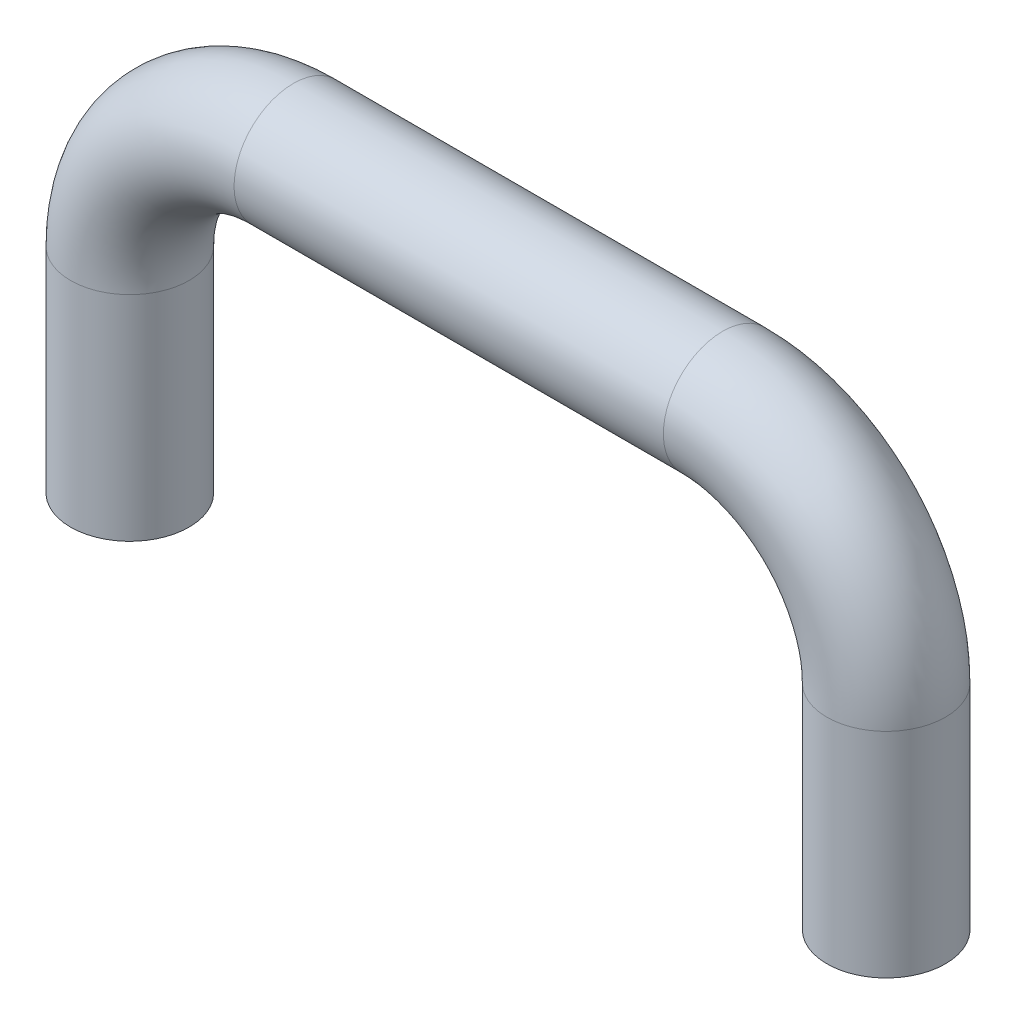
from build123d import *

# Parameters (mm, degrees)
ESQUISSE2_R             = 29
ESQUISSE7_R             = 15
ENL_V_MAT_EXTRU_2_DEPTH = 30


with BuildPart() as part:
    # Balayage2: sweep along a path in Esquisse1
    with BuildLine(Plane.XY) as balayage2_path:
        Line((-50.733288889, 10), (-50.733288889, 114.5))
        ThreePointArc((-50.733288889, 114.5), (-27.301831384, 171.068542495), (29.266711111, 194.5))
        Line((29.266711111, 194.5), (239.266711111, 194.5))
        ThreePointArc((239.266711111, 194.5), (295.835253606, 171.068542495), (319.266711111, 114.5))
        Line((319.266711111, 114.5), (319.266711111, 10))
    # Esquisse2 → Balayage2 (sweep)
    with BuildSketch(Plane(origin=(0, 10, 0), x_dir=(-1, 0, 0), z_dir=(0, 1, 0))):
        with Locations((-319.266711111, 0)):
            Circle(ESQUISSE2_R)
    sweep(path=balayage2_path.line)

    # Esquisse7 → Enl_v. mat.-Extru.2 (cut)
    with BuildSketch(Plane.XZ.offset(-10)):
        with Locations(Location((319.266711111, 0, 0), (0, 0, 270))):
            Circle(ESQUISSE7_R)
        with Locations(Location((-50.733288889, 0, 0), (0, 0, 270))):
            Circle(ESQUISSE7_R)
    extrude(amount=-ENL_V_MAT_EXTRU_2_DEPTH, mode=Mode.SUBTRACT)


solid = part.part
